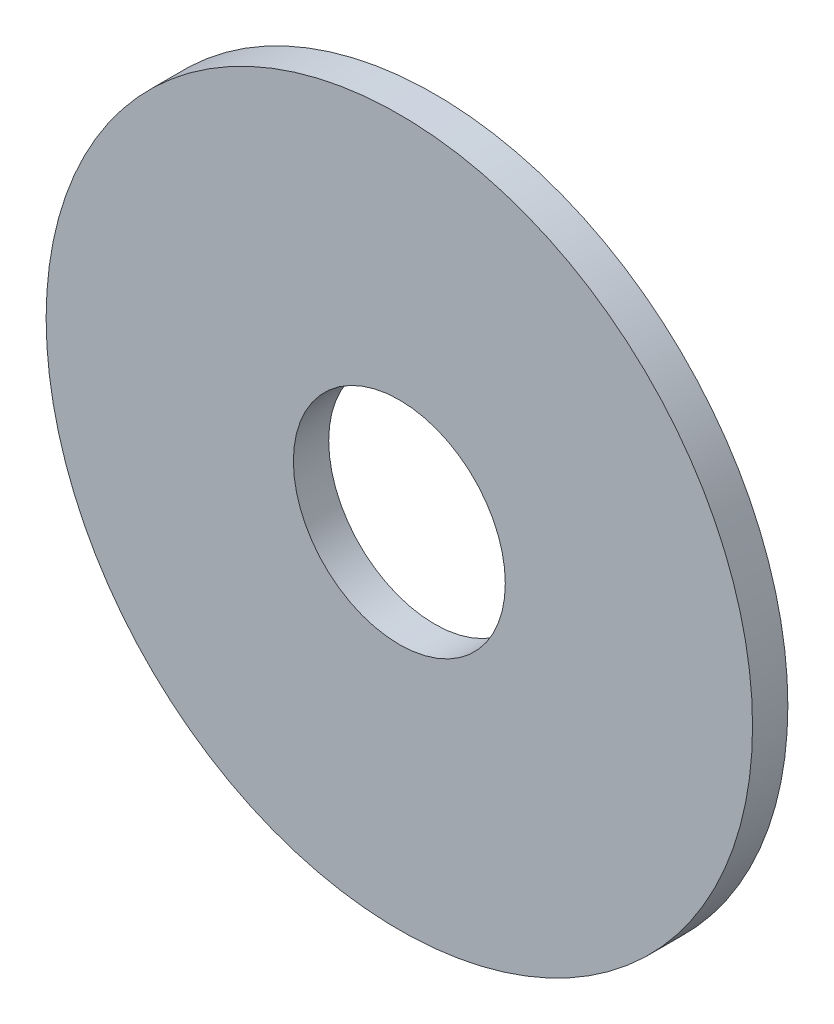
ISO-10303-21;
HEADER;
FILE_DESCRIPTION(('STEP AP214'),'2;1');
FILE_NAME('part.step','',(''),(''),'','','');
FILE_SCHEMA(('AUTOMOTIVE_DESIGN { 1 0 10303 214 1 1 1 1 }'));
ENDSEC;
DATA;
#1=APPLICATION_CONTEXT('core data for automotive mechanical design processes');
#2=APPLICATION_PROTOCOL_DEFINITION('international standard','automotive_design',2000,#1);
#3=PRODUCT_CONTEXT('',#1,'mechanical');
#4=PRODUCT('Part','Part','',(#3));
#5=PRODUCT_RELATED_PRODUCT_CATEGORY('part','',(#4));
#6=PRODUCT_DEFINITION_FORMATION('','',#4);
#7=PRODUCT_DEFINITION_CONTEXT('part definition',#1,'design');
#8=PRODUCT_DEFINITION('design','',#6,#7);
#9=PRODUCT_DEFINITION_SHAPE('','',#8);
#10=(LENGTH_UNIT() NAMED_UNIT(*) SI_UNIT(.MILLI.,.METRE.));
#11=(NAMED_UNIT(*) PLANE_ANGLE_UNIT() SI_UNIT($,.RADIAN.));
#12=(NAMED_UNIT(*) SI_UNIT($,.STERADIAN.) SOLID_ANGLE_UNIT());
#13=UNCERTAINTY_MEASURE_WITH_UNIT(LENGTH_MEASURE(1.E-05),#10,'distance_accuracy_value','');
#14=(GEOMETRIC_REPRESENTATION_CONTEXT(3) GLOBAL_UNCERTAINTY_ASSIGNED_CONTEXT((#13)) GLOBAL_UNIT_ASSIGNED_CONTEXT((#10,
#11,#12)) REPRESENTATION_CONTEXT('',''));
#15=CARTESIAN_POINT('',(0.,0.,0.));
#16=DIRECTION('',(0.,0.,1.));
#17=DIRECTION('',(1.,0.,0.));
#18=AXIS2_PLACEMENT_3D('',#15,#16,#17);
#19=CARTESIAN_POINT('',(0.,0.,1.5));
#20=DIRECTION('',(0.,0.,1.));
#21=DIRECTION('',(1.,0.,0.));
#22=AXIS2_PLACEMENT_3D('',#19,#20,#21);
#23=PLANE('',#22);
#24=CARTESIAN_POINT('',(0.,0.,1.5));
#25=DIRECTION('',(0.,0.,1.));
#26=DIRECTION('',(1.,0.,0.));
#27=AXIS2_PLACEMENT_3D('',#24,#25,#26);
#28=CIRCLE('',#27,15.);
#29=CARTESIAN_POINT('',(15.,0.,1.5));
#30=VERTEX_POINT('',#29);
#31=EDGE_CURVE('E10',#30,#30,#28,.T.);
#32=ORIENTED_EDGE('',*,*,#31,.T.);
#33=EDGE_LOOP('',(#32));
#34=FACE_BOUND('',#33,.T.);
#35=CARTESIAN_POINT('',(0.,0.,1.5));
#36=DIRECTION('',(0.,0.,1.));
#37=DIRECTION('',(1.,0.,0.));
#38=AXIS2_PLACEMENT_3D('',#35,#36,#37);
#39=CIRCLE('',#38,4.5);
#40=CARTESIAN_POINT('',(4.5,0.,1.5));
#41=VERTEX_POINT('',#40);
#42=EDGE_CURVE('E35',#41,#41,#39,.T.);
#43=ORIENTED_EDGE('',*,*,#42,.F.);
#44=EDGE_LOOP('',(#43));
#45=FACE_BOUND('',#44,.T.);
#46=ADVANCED_FACE('F24',(#34,#45),#23,.T.);
#47=CARTESIAN_POINT('',(0.,0.,0.));
#48=DIRECTION('',(0.,0.,1.));
#49=DIRECTION('',(1.,0.,0.));
#50=AXIS2_PLACEMENT_3D('',#47,#48,#49);
#51=PLANE('',#50);
#52=CARTESIAN_POINT('',(0.,0.,0.));
#53=DIRECTION('',(0.,0.,1.));
#54=DIRECTION('',(1.,0.,0.));
#55=AXIS2_PLACEMENT_3D('',#52,#53,#54);
#56=CIRCLE('',#55,15.);
#57=CARTESIAN_POINT('',(15.,0.,0.));
#58=VERTEX_POINT('',#57);
#59=EDGE_CURVE('E31',#58,#58,#56,.T.);
#60=ORIENTED_EDGE('',*,*,#59,.F.);
#61=EDGE_LOOP('',(#60));
#62=FACE_BOUND('',#61,.T.);
#63=CARTESIAN_POINT('',(0.,0.,0.));
#64=DIRECTION('',(0.,0.,1.));
#65=DIRECTION('',(1.,0.,0.));
#66=AXIS2_PLACEMENT_3D('',#63,#64,#65);
#67=CIRCLE('',#66,4.5);
#68=CARTESIAN_POINT('',(4.5,0.,0.));
#69=VERTEX_POINT('',#68);
#70=EDGE_CURVE('E39',#69,#69,#67,.T.);
#71=ORIENTED_EDGE('',*,*,#70,.T.);
#72=EDGE_LOOP('',(#71));
#73=FACE_BOUND('',#72,.T.);
#74=ADVANCED_FACE('F45',(#62,#73),#51,.F.);
#75=CARTESIAN_POINT('',(0.,0.,1.5));
#76=DIRECTION('',(0.,0.,-1.));
#77=DIRECTION('',(-1.,0.,0.));
#78=AXIS2_PLACEMENT_3D('',#75,#76,#77);
#79=CYLINDRICAL_SURFACE('',#78,15.);
#80=ORIENTED_EDGE('',*,*,#31,.F.);
#81=EDGE_LOOP('',(#80));
#82=FACE_BOUND('',#81,.T.);
#83=ORIENTED_EDGE('',*,*,#59,.T.);
#84=EDGE_LOOP('',(#83));
#85=FACE_BOUND('',#84,.T.);
#86=ADVANCED_FACE('F26',(#82,#85),#79,.T.);
#87=CARTESIAN_POINT('',(0.,0.,1.5));
#88=DIRECTION('',(0.,0.,-1.));
#89=DIRECTION('',(-1.,0.,0.));
#90=AXIS2_PLACEMENT_3D('',#87,#88,#89);
#91=CYLINDRICAL_SURFACE('',#90,4.5);
#92=ORIENTED_EDGE('',*,*,#42,.T.);
#93=EDGE_LOOP('',(#92));
#94=FACE_BOUND('',#93,.T.);
#95=ORIENTED_EDGE('',*,*,#70,.F.);
#96=EDGE_LOOP('',(#95));
#97=FACE_BOUND('',#96,.T.);
#98=ADVANCED_FACE('F47',(#94,#97),#91,.F.);
#99=CLOSED_SHELL('',(#46,#74,#86,#98));
#100=MANIFOLD_SOLID_BREP('B2',#99);
#101=ADVANCED_BREP_SHAPE_REPRESENTATION('',(#18,#100),#14);
#102=SHAPE_DEFINITION_REPRESENTATION(#9,#101);
ENDSEC;
END-ISO-10303-21;
